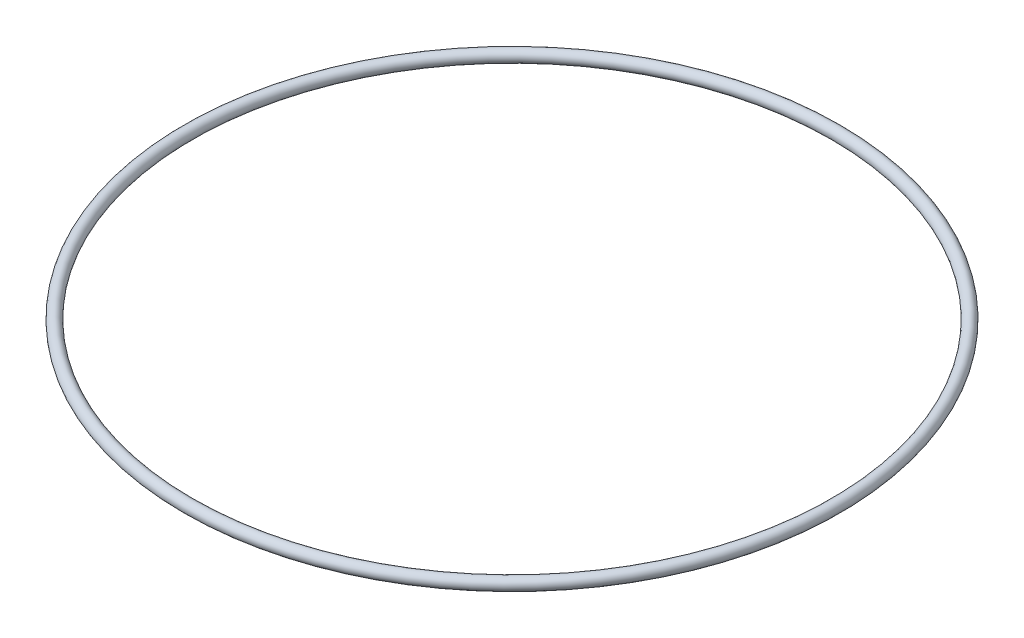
from build123d import *

# Parameters (mm, degrees)
ESQUISSE1_R = 1.5


with BuildPart() as part:
    # Esquisse1 → Base-R_volution (revolve)
    with BuildSketch(Plane.XY, mode=Mode.PRIVATE) as base_r_volution_sk:
        with Locations((81.5, 0)):
            Circle(ESQUISSE1_R)
    revolve(base_r_volution_sk.sketch.rotate(Axis((0, 1.5, 0), (0, -1, 0)), 90), axis=Axis((0, 1.5, 0), (0, -1, 0)))


solid = part.part
